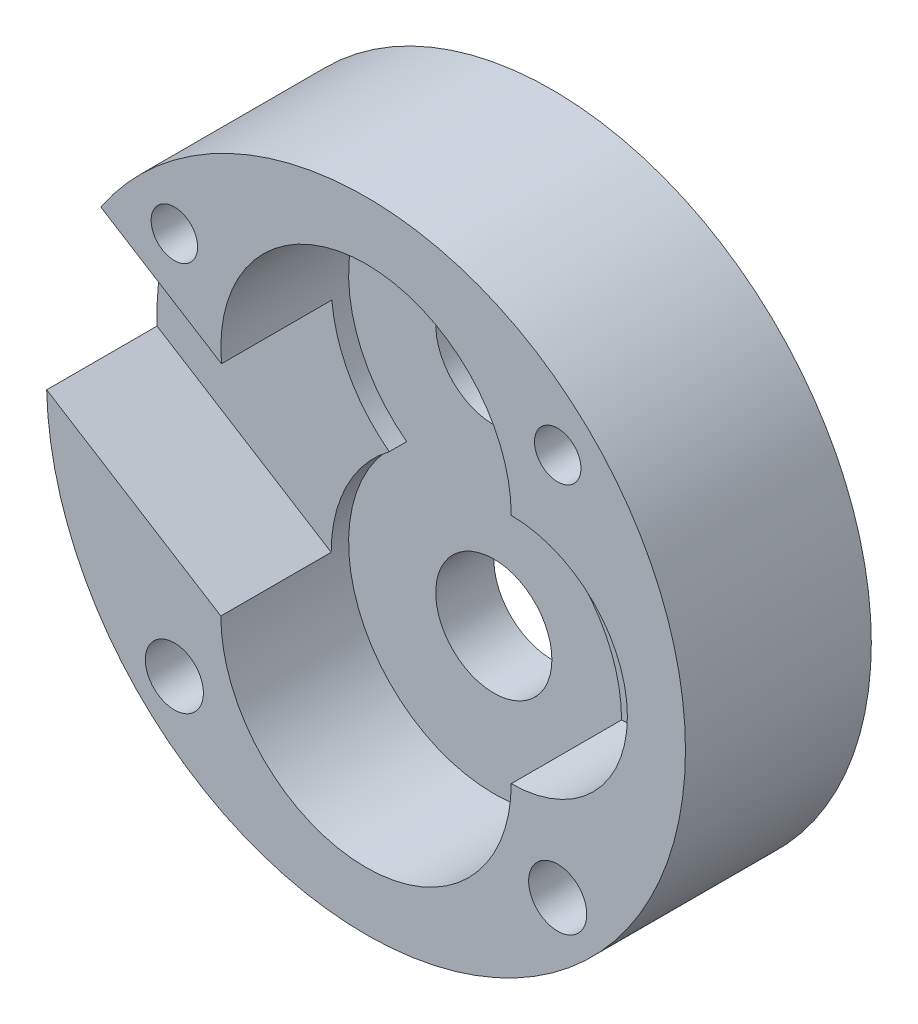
ISO-10303-21;
HEADER;
FILE_DESCRIPTION(('STEP AP214'),'2;1');
FILE_NAME('part.step','',(''),(''),'','','');
FILE_SCHEMA(('AUTOMOTIVE_DESIGN { 1 0 10303 214 1 1 1 1 }'));
ENDSEC;
DATA;
#1=APPLICATION_CONTEXT('core data for automotive mechanical design processes');
#2=APPLICATION_PROTOCOL_DEFINITION('international standard','automotive_design',2000,#1);
#3=PRODUCT_CONTEXT('',#1,'mechanical');
#4=PRODUCT('Part','Part','',(#3));
#5=PRODUCT_RELATED_PRODUCT_CATEGORY('part','',(#4));
#6=PRODUCT_DEFINITION_FORMATION('','',#4);
#7=PRODUCT_DEFINITION_CONTEXT('part definition',#1,'design');
#8=PRODUCT_DEFINITION('design','',#6,#7);
#9=PRODUCT_DEFINITION_SHAPE('','',#8);
#10=(LENGTH_UNIT() NAMED_UNIT(*) SI_UNIT(.MILLI.,.METRE.));
#11=(NAMED_UNIT(*) PLANE_ANGLE_UNIT() SI_UNIT($,.RADIAN.));
#12=(NAMED_UNIT(*) SI_UNIT($,.STERADIAN.) SOLID_ANGLE_UNIT());
#13=UNCERTAINTY_MEASURE_WITH_UNIT(LENGTH_MEASURE(1.E-05),#10,'distance_accuracy_value','');
#14=(GEOMETRIC_REPRESENTATION_CONTEXT(3) GLOBAL_UNCERTAINTY_ASSIGNED_CONTEXT((#13)) GLOBAL_UNIT_ASSIGNED_CONTEXT((#10,
#11,#12)) REPRESENTATION_CONTEXT('',''));
#15=CARTESIAN_POINT('',(0.,0.,0.));
#16=DIRECTION('',(0.,0.,1.));
#17=DIRECTION('',(1.,0.,0.));
#18=AXIS2_PLACEMENT_3D('',#15,#16,#17);
#19=CARTESIAN_POINT('',(0.,20.,-22.));
#20=DIRECTION('',(0.,0.,1.));
#21=DIRECTION('',(1.,0.,0.));
#22=AXIS2_PLACEMENT_3D('',#19,#20,#21);
#23=CYLINDRICAL_SURFACE('',#22,25.);
#24=DIRECTION('',(0.,0.,1.));
#25=VECTOR('',#24,1.);
#26=CARTESIAN_POINT('',(25.,20.,-19.));
#27=LINE('',#26,#25);
#28=CARTESIAN_POINT('',(25.,20.,-19.));
#29=VERTEX_POINT('',#28);
#30=CARTESIAN_POINT('',(25.,20.,0.));
#31=VERTEX_POINT('',#30);
#32=EDGE_CURVE('E110',#29,#31,#27,.T.);
#33=ORIENTED_EDGE('',*,*,#32,.T.);
#34=CARTESIAN_POINT('',(0.,20.,0.));
#35=DIRECTION('',(0.,0.,1.));
#36=DIRECTION('',(1.,0.,0.));
#37=AXIS2_PLACEMENT_3D('',#34,#35,#36);
#38=CIRCLE('',#37,25.);
#39=CARTESIAN_POINT('',(-24.8907586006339,17.6654473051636,0.));
#40=VERTEX_POINT('',#39);
#41=EDGE_CURVE('E147',#31,#40,#38,.T.);
#42=ORIENTED_EDGE('',*,*,#41,.T.);
#43=DIRECTION('',(0.,0.,1.));
#44=VECTOR('',#43,1.);
#45=CARTESIAN_POINT('',(-24.8907586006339,17.6654473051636,-19.));
#46=LINE('',#45,#44);
#47=CARTESIAN_POINT('',(-24.8907586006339,17.6654473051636,-19.));
#48=VERTEX_POINT('',#47);
#49=EDGE_CURVE('E141',#48,#40,#46,.T.);
#50=ORIENTED_EDGE('',*,*,#49,.F.);
#51=CARTESIAN_POINT('',(0.,20.,-19.));
#52=DIRECTION('',(0.,0.,1.));
#53=DIRECTION('',(1.,0.,0.));
#54=AXIS2_PLACEMENT_3D('',#51,#52,#53);
#55=CIRCLE('',#54,25.);
#56=CARTESIAN_POINT('',(-15.,0.,-19.));
#57=VERTEX_POINT('',#56);
#58=EDGE_CURVE('E134',#48,#57,#55,.T.);
#59=ORIENTED_EDGE('',*,*,#58,.T.);
#60=DIRECTION('',(0.,0.,1.));
#61=VECTOR('',#60,1.);
#62=CARTESIAN_POINT('',(-15.,0.,-22.));
#63=LINE('',#62,#61);
#64=CARTESIAN_POINT('',(-15.,0.,-22.));
#65=VERTEX_POINT('',#64);
#66=EDGE_CURVE('E164',#65,#57,#63,.T.);
#67=ORIENTED_EDGE('',*,*,#66,.F.);
#68=CARTESIAN_POINT('',(0.,20.,-22.));
#69=DIRECTION('',(0.,0.,1.));
#70=DIRECTION('',(1.,0.,0.));
#71=AXIS2_PLACEMENT_3D('',#68,#69,#70);
#72=CIRCLE('',#71,25.);
#73=CARTESIAN_POINT('',(15.,0.,-22.));
#74=VERTEX_POINT('',#73);
#75=EDGE_CURVE('E158',#74,#65,#72,.T.);
#76=ORIENTED_EDGE('',*,*,#75,.F.);
#77=DIRECTION('',(0.,0.,1.));
#78=VECTOR('',#77,1.);
#79=CARTESIAN_POINT('',(15.,0.,-22.));
#80=LINE('',#79,#78);
#81=CARTESIAN_POINT('',(15.,0.,-19.));
#82=VERTEX_POINT('',#81);
#83=EDGE_CURVE('E125',#74,#82,#80,.T.);
#84=ORIENTED_EDGE('',*,*,#83,.T.);
#85=CARTESIAN_POINT('',(0.,20.,-19.));
#86=DIRECTION('',(0.,0.,1.));
#87=DIRECTION('',(1.,0.,0.));
#88=AXIS2_PLACEMENT_3D('',#85,#86,#87);
#89=CIRCLE('',#88,25.);
#90=EDGE_CURVE('E57',#82,#29,#89,.T.);
#91=ORIENTED_EDGE('',*,*,#90,.T.);
#92=EDGE_LOOP('',(#33,#42,#50,#59,#67,#76,#84,#91));
#93=FACE_BOUND('',#92,.T.);
#94=ADVANCED_FACE('F39',(#93),#23,.F.);
#95=CARTESIAN_POINT('',(0.,0.,0.));
#96=DIRECTION('',(0.,0.,1.));
#97=DIRECTION('',(1.,0.,0.));
#98=AXIS2_PLACEMENT_3D('',#95,#96,#97);
#99=PLANE('',#98);
#100=CARTESIAN_POINT('',(-33.,-33.,0.));
#101=DIRECTION('',(0.,0.,1.));
#102=DIRECTION('',(1.,0.,0.));
#103=AXIS2_PLACEMENT_3D('',#100,#101,#102);
#104=CIRCLE('',#103,5.);
#105=CARTESIAN_POINT('',(-28.,-33.,0.));
#106=VERTEX_POINT('',#105);
#107=EDGE_CURVE('E177',#106,#106,#104,.T.);
#108=ORIENTED_EDGE('',*,*,#107,.F.);
#109=EDGE_LOOP('',(#108));
#110=FACE_BOUND('',#109,.T.);
#111=CARTESIAN_POINT('',(33.,-33.,0.));
#112=DIRECTION('',(0.,0.,1.));
#113=DIRECTION('',(1.,0.,0.));
#114=AXIS2_PLACEMENT_3D('',#111,#112,#113);
#115=CIRCLE('',#114,5.);
#116=CARTESIAN_POINT('',(38.,-33.,0.));
#117=VERTEX_POINT('',#116);
#118=EDGE_CURVE('E195',#117,#117,#115,.T.);
#119=ORIENTED_EDGE('',*,*,#118,.F.);
#120=EDGE_LOOP('',(#119));
#121=FACE_BOUND('',#120,.T.);
#122=CARTESIAN_POINT('',(33.,33.,0.));
#123=DIRECTION('',(0.,0.,1.));
#124=DIRECTION('',(1.,0.,0.));
#125=AXIS2_PLACEMENT_3D('',#122,#123,#124);
#126=CIRCLE('',#125,4.);
#127=CARTESIAN_POINT('',(37.,33.,0.));
#128=VERTEX_POINT('',#127);
#129=EDGE_CURVE('E200',#128,#128,#126,.T.);
#130=ORIENTED_EDGE('',*,*,#129,.F.);
#131=EDGE_LOOP('',(#130));
#132=FACE_BOUND('',#131,.T.);
#133=CARTESIAN_POINT('',(-33.,33.,0.));
#134=DIRECTION('',(0.,0.,1.));
#135=DIRECTION('',(1.,0.,0.));
#136=AXIS2_PLACEMENT_3D('',#133,#134,#135);
#137=CIRCLE('',#136,4.);
#138=CARTESIAN_POINT('',(-29.,33.,0.));
#139=VERTEX_POINT('',#138);
#140=EDGE_CURVE('E205',#139,#139,#137,.T.);
#141=ORIENTED_EDGE('',*,*,#140,.F.);
#142=EDGE_LOOP('',(#141));
#143=FACE_BOUND('',#142,.T.);
#144=ORIENTED_EDGE('',*,*,#41,.F.);
#145=CARTESIAN_POINT('',(25.,0.,0.));
#146=DIRECTION('',(0.,0.,1.));
#147=DIRECTION('',(1.,0.,0.));
#148=AXIS2_PLACEMENT_3D('',#145,#146,#147);
#149=CIRCLE('',#148,20.);
#150=CARTESIAN_POINT('',(25.,-20.,0.));
#151=VERTEX_POINT('',#150);
#152=EDGE_CURVE('E115',#31,#151,#149,.F.);
#153=ORIENTED_EDGE('',*,*,#152,.T.);
#154=CARTESIAN_POINT('',(0.,-20.,0.));
#155=DIRECTION('',(0.,0.,1.));
#156=DIRECTION('',(1.,0.,0.));
#157=AXIS2_PLACEMENT_3D('',#154,#155,#156);
#158=CIRCLE('',#157,25.);
#159=CARTESIAN_POINT('',(-25.,-20.,0.));
#160=VERTEX_POINT('',#159);
#161=EDGE_CURVE('E165',#160,#151,#158,.T.);
#162=ORIENTED_EDGE('',*,*,#161,.F.);
#163=DIRECTION('',(0.848048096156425,-0.529919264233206,0.));
#164=VECTOR('',#163,1.);
#165=CARTESIAN_POINT('',(-16.0083011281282,-25.6186370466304,0.));
#166=LINE('',#165,#164);
#167=CARTESIAN_POINT('',(-54.9854969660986,-1.2629819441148,0.));
#168=VERTEX_POINT('',#167);
#169=EDGE_CURVE('E132',#168,#160,#166,.T.);
#170=ORIENTED_EDGE('',*,*,#169,.F.);
#171=CARTESIAN_POINT('',(0.,0.,0.));
#172=DIRECTION('',(0.,0.,1.));
#173=DIRECTION('',(1.,0.,0.));
#174=AXIS2_PLACEMENT_3D('',#171,#172,#173);
#175=CIRCLE('',#174,55.);
#176=CARTESIAN_POINT('',(-45.6687921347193,30.6490036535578,0.));
#177=VERTEX_POINT('',#176);
#178=EDGE_CURVE('E48',#168,#177,#175,.T.);
#179=ORIENTED_EDGE('',*,*,#178,.T.);
#180=DIRECTION('',(0.848048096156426,-0.529919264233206,0.));
#181=VECTOR('',#180,1.);
#182=CARTESIAN_POINT('',(0.949115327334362,1.51890203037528,0.));
#183=LINE('',#182,#181);
#184=EDGE_CURVE('E129',#177,#40,#183,.T.);
#185=ORIENTED_EDGE('',*,*,#184,.T.);
#186=EDGE_LOOP('',(#144,#153,#162,#170,#179,#185));
#187=FACE_BOUND('',#186,.T.);
#188=ADVANCED_FACE('F211',(#110,#121,#132,#143,#187),#99,.T.);
#189=CARTESIAN_POINT('',(0.,-20.,-22.));
#190=DIRECTION('',(0.,0.,1.));
#191=DIRECTION('',(1.,0.,0.));
#192=AXIS2_PLACEMENT_3D('',#189,#190,#191);
#193=CYLINDRICAL_SURFACE('',#192,25.);
#194=DIRECTION('',(0.,0.,1.));
#195=VECTOR('',#194,1.);
#196=CARTESIAN_POINT('',(25.,-20.,-19.));
#197=LINE('',#196,#195);
#198=CARTESIAN_POINT('',(25.,-20.,-19.));
#199=VERTEX_POINT('',#198);
#200=EDGE_CURVE('E113',#199,#151,#197,.T.);
#201=ORIENTED_EDGE('',*,*,#200,.F.);
#202=CARTESIAN_POINT('',(0.,-20.,-19.));
#203=DIRECTION('',(0.,0.,1.));
#204=DIRECTION('',(1.,0.,0.));
#205=AXIS2_PLACEMENT_3D('',#202,#203,#204);
#206=CIRCLE('',#205,25.);
#207=EDGE_CURVE('E117',#199,#82,#206,.T.);
#208=ORIENTED_EDGE('',*,*,#207,.T.);
#209=ORIENTED_EDGE('',*,*,#83,.F.);
#210=CARTESIAN_POINT('',(0.,-20.,-22.));
#211=DIRECTION('',(0.,0.,1.));
#212=DIRECTION('',(1.,0.,0.));
#213=AXIS2_PLACEMENT_3D('',#210,#211,#212);
#214=CIRCLE('',#213,25.);
#215=EDGE_CURVE('E161',#65,#74,#214,.T.);
#216=ORIENTED_EDGE('',*,*,#215,.F.);
#217=ORIENTED_EDGE('',*,*,#66,.T.);
#218=CARTESIAN_POINT('',(0.,-20.,-19.));
#219=DIRECTION('',(0.,0.,1.));
#220=DIRECTION('',(1.,0.,0.));
#221=AXIS2_PLACEMENT_3D('',#218,#219,#220);
#222=CIRCLE('',#221,25.);
#223=CARTESIAN_POINT('',(-25.,-20.,-19.));
#224=VERTEX_POINT('',#223);
#225=EDGE_CURVE('E133',#57,#224,#222,.T.);
#226=ORIENTED_EDGE('',*,*,#225,.T.);
#227=DIRECTION('',(0.,0.,1.));
#228=VECTOR('',#227,1.);
#229=CARTESIAN_POINT('',(-25.,-20.,-19.));
#230=LINE('',#229,#228);
#231=EDGE_CURVE('E150',#224,#160,#230,.T.);
#232=ORIENTED_EDGE('',*,*,#231,.T.);
#233=ORIENTED_EDGE('',*,*,#161,.T.);
#234=EDGE_LOOP('',(#201,#208,#209,#216,#217,#226,#232,#233));
#235=FACE_BOUND('',#234,.T.);
#236=ADVANCED_FACE('F212',(#235),#193,.F.);
#237=CARTESIAN_POINT('',(0.,0.,-32.));
#238=DIRECTION('',(0.,0.,1.));
#239=DIRECTION('',(1.,0.,0.));
#240=AXIS2_PLACEMENT_3D('',#237,#238,#239);
#241=CYLINDRICAL_SURFACE('',#240,55.);
#242=DIRECTION('',(0.,0.,1.));
#243=VECTOR('',#242,1.);
#244=CARTESIAN_POINT('',(-54.9854969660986,-1.2629819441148,-19.));
#245=LINE('',#244,#243);
#246=CARTESIAN_POINT('',(-54.9854969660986,-1.2629819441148,-19.));
#247=VERTEX_POINT('',#246);
#248=EDGE_CURVE('E151',#247,#168,#245,.T.);
#249=ORIENTED_EDGE('',*,*,#248,.F.);
#250=CARTESIAN_POINT('',(0.,0.,-19.));
#251=DIRECTION('',(0.,0.,1.));
#252=DIRECTION('',(1.,0.,0.));
#253=AXIS2_PLACEMENT_3D('',#250,#251,#252);
#254=CIRCLE('',#253,55.);
#255=CARTESIAN_POINT('',(-45.6687921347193,30.6490036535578,-19.));
#256=VERTEX_POINT('',#255);
#257=EDGE_CURVE('E137',#256,#247,#254,.T.);
#258=ORIENTED_EDGE('',*,*,#257,.F.);
#259=DIRECTION('',(0.,0.,1.));
#260=VECTOR('',#259,1.);
#261=CARTESIAN_POINT('',(-45.6687921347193,30.6490036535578,-19.));
#262=LINE('',#261,#260);
#263=EDGE_CURVE('E153',#256,#177,#262,.T.);
#264=ORIENTED_EDGE('',*,*,#263,.T.);
#265=ORIENTED_EDGE('',*,*,#178,.F.);
#266=EDGE_LOOP('',(#249,#258,#264,#265));
#267=FACE_BOUND('',#266,.T.);
#268=CARTESIAN_POINT('',(0.,0.,-32.));
#269=DIRECTION('',(0.,0.,1.));
#270=DIRECTION('',(1.,0.,0.));
#271=AXIS2_PLACEMENT_3D('',#268,#269,#270);
#272=CIRCLE('',#271,55.);
#273=CARTESIAN_POINT('',(55.,0.,-32.));
#274=VERTEX_POINT('',#273);
#275=EDGE_CURVE('E11',#274,#274,#272,.T.);
#276=ORIENTED_EDGE('',*,*,#275,.T.);
#277=EDGE_LOOP('',(#276));
#278=FACE_BOUND('',#277,.T.);
#279=ADVANCED_FACE('F41',(#267,#278),#241,.T.);
#280=CARTESIAN_POINT('',(0.,0.,-32.));
#281=DIRECTION('',(0.,0.,1.));
#282=DIRECTION('',(1.,0.,0.));
#283=AXIS2_PLACEMENT_3D('',#280,#281,#282);
#284=PLANE('',#283);
#285=CARTESIAN_POINT('',(0.,20.,-32.));
#286=DIRECTION('',(0.,0.,1.));
#287=DIRECTION('',(1.,0.,0.));
#288=AXIS2_PLACEMENT_3D('',#285,#286,#287);
#289=CIRCLE('',#288,10.);
#290=CARTESIAN_POINT('',(10.,20.,-32.));
#291=VERTEX_POINT('',#290);
#292=EDGE_CURVE('E190',#291,#291,#289,.T.);
#293=ORIENTED_EDGE('',*,*,#292,.T.);
#294=EDGE_LOOP('',(#293));
#295=FACE_BOUND('',#294,.T.);
#296=CARTESIAN_POINT('',(0.,-20.,-32.));
#297=DIRECTION('',(0.,0.,1.));
#298=DIRECTION('',(1.,0.,0.));
#299=AXIS2_PLACEMENT_3D('',#296,#297,#298);
#300=CIRCLE('',#299,10.);
#301=CARTESIAN_POINT('',(10.,-20.,-32.));
#302=VERTEX_POINT('',#301);
#303=EDGE_CURVE('E178',#302,#302,#300,.T.);
#304=ORIENTED_EDGE('',*,*,#303,.T.);
#305=EDGE_LOOP('',(#304));
#306=FACE_BOUND('',#305,.T.);
#307=CARTESIAN_POINT('',(-33.,-33.,-32.));
#308=DIRECTION('',(0.,0.,1.));
#309=DIRECTION('',(1.,0.,0.));
#310=AXIS2_PLACEMENT_3D('',#307,#308,#309);
#311=CIRCLE('',#310,5.);
#312=CARTESIAN_POINT('',(-28.,-33.,-32.));
#313=VERTEX_POINT('',#312);
#314=EDGE_CURVE('E173',#313,#313,#311,.T.);
#315=ORIENTED_EDGE('',*,*,#314,.T.);
#316=EDGE_LOOP('',(#315));
#317=FACE_BOUND('',#316,.T.);
#318=CARTESIAN_POINT('',(33.,-33.,-32.));
#319=DIRECTION('',(0.,0.,1.));
#320=DIRECTION('',(1.,0.,0.));
#321=AXIS2_PLACEMENT_3D('',#318,#319,#320);
#322=CIRCLE('',#321,5.);
#323=CARTESIAN_POINT('',(38.,-33.,-32.));
#324=VERTEX_POINT('',#323);
#325=EDGE_CURVE('E194',#324,#324,#322,.T.);
#326=ORIENTED_EDGE('',*,*,#325,.T.);
#327=EDGE_LOOP('',(#326));
#328=FACE_BOUND('',#327,.T.);
#329=CARTESIAN_POINT('',(33.,33.,-32.));
#330=DIRECTION('',(0.,0.,1.));
#331=DIRECTION('',(1.,0.,0.));
#332=AXIS2_PLACEMENT_3D('',#329,#330,#331);
#333=CIRCLE('',#332,4.);
#334=CARTESIAN_POINT('',(37.,33.,-32.));
#335=VERTEX_POINT('',#334);
#336=EDGE_CURVE('E198',#335,#335,#333,.T.);
#337=ORIENTED_EDGE('',*,*,#336,.T.);
#338=EDGE_LOOP('',(#337));
#339=FACE_BOUND('',#338,.T.);
#340=CARTESIAN_POINT('',(-33.,33.,-32.));
#341=DIRECTION('',(0.,0.,1.));
#342=DIRECTION('',(1.,0.,0.));
#343=AXIS2_PLACEMENT_3D('',#340,#341,#342);
#344=CIRCLE('',#343,4.);
#345=CARTESIAN_POINT('',(-29.,33.,-32.));
#346=VERTEX_POINT('',#345);
#347=EDGE_CURVE('E126',#346,#346,#344,.T.);
#348=ORIENTED_EDGE('',*,*,#347,.T.);
#349=EDGE_LOOP('',(#348));
#350=FACE_BOUND('',#349,.T.);
#351=ORIENTED_EDGE('',*,*,#275,.F.);
#352=EDGE_LOOP('',(#351));
#353=FACE_BOUND('',#352,.T.);
#354=ADVANCED_FACE('F228',(#295,#306,#317,#328,#339,#350,#353),#284,.F.);
#355=CARTESIAN_POINT('',(0.,0.,-22.));
#356=DIRECTION('',(0.,0.,1.));
#357=DIRECTION('',(1.,0.,0.));
#358=AXIS2_PLACEMENT_3D('',#355,#356,#357);
#359=PLANE('',#358);
#360=CARTESIAN_POINT('',(0.,20.,-22.));
#361=DIRECTION('',(0.,0.,1.));
#362=DIRECTION('',(1.,0.,0.));
#363=AXIS2_PLACEMENT_3D('',#360,#361,#362);
#364=CIRCLE('',#363,10.);
#365=CARTESIAN_POINT('',(10.,20.,-22.));
#366=VERTEX_POINT('',#365);
#367=EDGE_CURVE('E43',#366,#366,#364,.T.);
#368=ORIENTED_EDGE('',*,*,#367,.F.);
#369=EDGE_LOOP('',(#368));
#370=FACE_BOUND('',#369,.T.);
#371=CARTESIAN_POINT('',(0.,-20.,-22.));
#372=DIRECTION('',(0.,0.,1.));
#373=DIRECTION('',(1.,0.,0.));
#374=AXIS2_PLACEMENT_3D('',#371,#372,#373);
#375=CIRCLE('',#374,10.);
#376=CARTESIAN_POINT('',(10.,-20.,-22.));
#377=VERTEX_POINT('',#376);
#378=EDGE_CURVE('E175',#377,#377,#375,.T.);
#379=ORIENTED_EDGE('',*,*,#378,.F.);
#380=EDGE_LOOP('',(#379));
#381=FACE_BOUND('',#380,.T.);
#382=ORIENTED_EDGE('',*,*,#75,.T.);
#383=ORIENTED_EDGE('',*,*,#215,.T.);
#384=EDGE_LOOP('',(#382,#383));
#385=FACE_BOUND('',#384,.T.);
#386=ADVANCED_FACE('F229',(#370,#381,#385),#359,.T.);
#387=CARTESIAN_POINT('',(-16.0083011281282,-25.6186370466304,-19.));
#388=DIRECTION('',(-0.529919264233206,-0.848048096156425,0.));
#389=DIRECTION('',(0.848048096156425,-0.529919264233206,0.));
#390=AXIS2_PLACEMENT_3D('',#387,#388,#389);
#391=PLANE('',#390);
#392=ORIENTED_EDGE('',*,*,#169,.T.);
#393=ORIENTED_EDGE('',*,*,#231,.F.);
#394=DIRECTION('',(0.848048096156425,-0.529919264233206,0.));
#395=VECTOR('',#394,1.);
#396=CARTESIAN_POINT('',(-16.0083011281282,-25.6186370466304,-19.));
#397=LINE('',#396,#395);
#398=EDGE_CURVE('E61',#247,#224,#397,.T.);
#399=ORIENTED_EDGE('',*,*,#398,.F.);
#400=ORIENTED_EDGE('',*,*,#248,.T.);
#401=EDGE_LOOP('',(#392,#393,#399,#400));
#402=FACE_BOUND('',#401,.T.);
#403=ADVANCED_FACE('F226',(#402),#391,.F.);
#404=CARTESIAN_POINT('',(0.949115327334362,1.51890203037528,-19.));
#405=DIRECTION('',(-0.529919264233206,-0.848048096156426,0.));
#406=DIRECTION('',(0.848048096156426,-0.529919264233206,0.));
#407=AXIS2_PLACEMENT_3D('',#404,#405,#406);
#408=PLANE('',#407);
#409=ORIENTED_EDGE('',*,*,#184,.F.);
#410=ORIENTED_EDGE('',*,*,#263,.F.);
#411=DIRECTION('',(0.848048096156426,-0.529919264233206,0.));
#412=VECTOR('',#411,1.);
#413=CARTESIAN_POINT('',(0.949115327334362,1.51890203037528,-19.));
#414=LINE('',#413,#412);
#415=EDGE_CURVE('E140',#256,#48,#414,.T.);
#416=ORIENTED_EDGE('',*,*,#415,.T.);
#417=ORIENTED_EDGE('',*,*,#49,.T.);
#418=EDGE_LOOP('',(#409,#410,#416,#417));
#419=FACE_BOUND('',#418,.T.);
#420=ADVANCED_FACE('F218',(#419),#408,.T.);
#421=CARTESIAN_POINT('',(0.,0.,-19.));
#422=DIRECTION('',(0.,0.,1.));
#423=DIRECTION('',(1.,0.,0.));
#424=AXIS2_PLACEMENT_3D('',#421,#422,#423);
#425=PLANE('',#424);
#426=ORIENTED_EDGE('',*,*,#225,.F.);
#427=ORIENTED_EDGE('',*,*,#58,.F.);
#428=ORIENTED_EDGE('',*,*,#415,.F.);
#429=ORIENTED_EDGE('',*,*,#257,.T.);
#430=ORIENTED_EDGE('',*,*,#398,.T.);
#431=EDGE_LOOP('',(#426,#427,#428,#429,#430));
#432=FACE_BOUND('',#431,.T.);
#433=ADVANCED_FACE('F224',(#432),#425,.T.);
#434=CARTESIAN_POINT('',(25.,0.,-19.));
#435=DIRECTION('',(0.,0.,1.));
#436=DIRECTION('',(1.,0.,0.));
#437=AXIS2_PLACEMENT_3D('',#434,#435,#436);
#438=CYLINDRICAL_SURFACE('',#437,20.);
#439=ORIENTED_EDGE('',*,*,#152,.F.);
#440=ORIENTED_EDGE('',*,*,#32,.F.);
#441=CARTESIAN_POINT('',(25.,0.,-19.));
#442=DIRECTION('',(0.,0.,1.));
#443=DIRECTION('',(1.,0.,0.));
#444=AXIS2_PLACEMENT_3D('',#441,#442,#443);
#445=CIRCLE('',#444,20.);
#446=EDGE_CURVE('E108',#29,#199,#445,.F.);
#447=ORIENTED_EDGE('',*,*,#446,.T.);
#448=ORIENTED_EDGE('',*,*,#200,.T.);
#449=EDGE_LOOP('',(#439,#440,#447,#448));
#450=FACE_BOUND('',#449,.T.);
#451=ADVANCED_FACE('F107',(#450),#438,.F.);
#452=CARTESIAN_POINT('',(0.,0.,-19.));
#453=DIRECTION('',(0.,0.,1.));
#454=DIRECTION('',(1.,0.,0.));
#455=AXIS2_PLACEMENT_3D('',#452,#453,#454);
#456=PLANE('',#455);
#457=ORIENTED_EDGE('',*,*,#446,.F.);
#458=ORIENTED_EDGE('',*,*,#90,.F.);
#459=ORIENTED_EDGE('',*,*,#207,.F.);
#460=EDGE_LOOP('',(#457,#458,#459));
#461=FACE_BOUND('',#460,.T.);
#462=ADVANCED_FACE('F120',(#461),#456,.T.);
#463=CARTESIAN_POINT('',(-33.,33.,-32.));
#464=DIRECTION('',(0.,0.,1.));
#465=DIRECTION('',(1.,0.,0.));
#466=AXIS2_PLACEMENT_3D('',#463,#464,#465);
#467=CYLINDRICAL_SURFACE('',#466,4.);
#468=ORIENTED_EDGE('',*,*,#347,.F.);
#469=EDGE_LOOP('',(#468));
#470=FACE_BOUND('',#469,.T.);
#471=ORIENTED_EDGE('',*,*,#140,.T.);
#472=EDGE_LOOP('',(#471));
#473=FACE_BOUND('',#472,.T.);
#474=ADVANCED_FACE('F207',(#470,#473),#467,.F.);
#475=CARTESIAN_POINT('',(33.,33.,-32.));
#476=DIRECTION('',(0.,0.,1.));
#477=DIRECTION('',(1.,0.,0.));
#478=AXIS2_PLACEMENT_3D('',#475,#476,#477);
#479=CYLINDRICAL_SURFACE('',#478,4.);
#480=ORIENTED_EDGE('',*,*,#336,.F.);
#481=EDGE_LOOP('',(#480));
#482=FACE_BOUND('',#481,.T.);
#483=ORIENTED_EDGE('',*,*,#129,.T.);
#484=EDGE_LOOP('',(#483));
#485=FACE_BOUND('',#484,.T.);
#486=ADVANCED_FACE('F309',(#482,#485),#479,.F.);
#487=CARTESIAN_POINT('',(33.,-33.,-32.));
#488=DIRECTION('',(0.,0.,1.));
#489=DIRECTION('',(1.,0.,0.));
#490=AXIS2_PLACEMENT_3D('',#487,#488,#489);
#491=CYLINDRICAL_SURFACE('',#490,5.);
#492=ORIENTED_EDGE('',*,*,#325,.F.);
#493=EDGE_LOOP('',(#492));
#494=FACE_BOUND('',#493,.T.);
#495=ORIENTED_EDGE('',*,*,#118,.T.);
#496=EDGE_LOOP('',(#495));
#497=FACE_BOUND('',#496,.T.);
#498=ADVANCED_FACE('F318',(#494,#497),#491,.F.);
#499=CARTESIAN_POINT('',(-33.,-33.,-32.));
#500=DIRECTION('',(0.,0.,1.));
#501=DIRECTION('',(1.,0.,0.));
#502=AXIS2_PLACEMENT_3D('',#499,#500,#501);
#503=CYLINDRICAL_SURFACE('',#502,5.);
#504=ORIENTED_EDGE('',*,*,#314,.F.);
#505=EDGE_LOOP('',(#504));
#506=FACE_BOUND('',#505,.T.);
#507=ORIENTED_EDGE('',*,*,#107,.T.);
#508=EDGE_LOOP('',(#507));
#509=FACE_BOUND('',#508,.T.);
#510=ADVANCED_FACE('F326',(#506,#509),#503,.F.);
#511=CARTESIAN_POINT('',(0.,-20.,-32.));
#512=DIRECTION('',(0.,0.,1.));
#513=DIRECTION('',(1.,0.,0.));
#514=AXIS2_PLACEMENT_3D('',#511,#512,#513);
#515=CYLINDRICAL_SURFACE('',#514,10.);
#516=ORIENTED_EDGE('',*,*,#378,.T.);
#517=EDGE_LOOP('',(#516));
#518=FACE_BOUND('',#517,.T.);
#519=ORIENTED_EDGE('',*,*,#303,.F.);
#520=EDGE_LOOP('',(#519));
#521=FACE_BOUND('',#520,.T.);
#522=ADVANCED_FACE('F331',(#518,#521),#515,.F.);
#523=CARTESIAN_POINT('',(0.,20.,-32.));
#524=DIRECTION('',(0.,0.,1.));
#525=DIRECTION('',(1.,0.,0.));
#526=AXIS2_PLACEMENT_3D('',#523,#524,#525);
#527=CYLINDRICAL_SURFACE('',#526,10.);
#528=ORIENTED_EDGE('',*,*,#367,.T.);
#529=EDGE_LOOP('',(#528));
#530=FACE_BOUND('',#529,.T.);
#531=ORIENTED_EDGE('',*,*,#292,.F.);
#532=EDGE_LOOP('',(#531));
#533=FACE_BOUND('',#532,.T.);
#534=ADVANCED_FACE('F345',(#530,#533),#527,.F.);
#535=CLOSED_SHELL('',(#94,#188,#236,#279,#354,#386,#403,#420,#433,#451,#462,#474,#486,#498,#510,
#522,#534));
#536=MANIFOLD_SOLID_BREP('B2',#535);
#537=ADVANCED_BREP_SHAPE_REPRESENTATION('',(#18,#536),#14);
#538=SHAPE_DEFINITION_REPRESENTATION(#9,#537);
ENDSEC;
END-ISO-10303-21;
